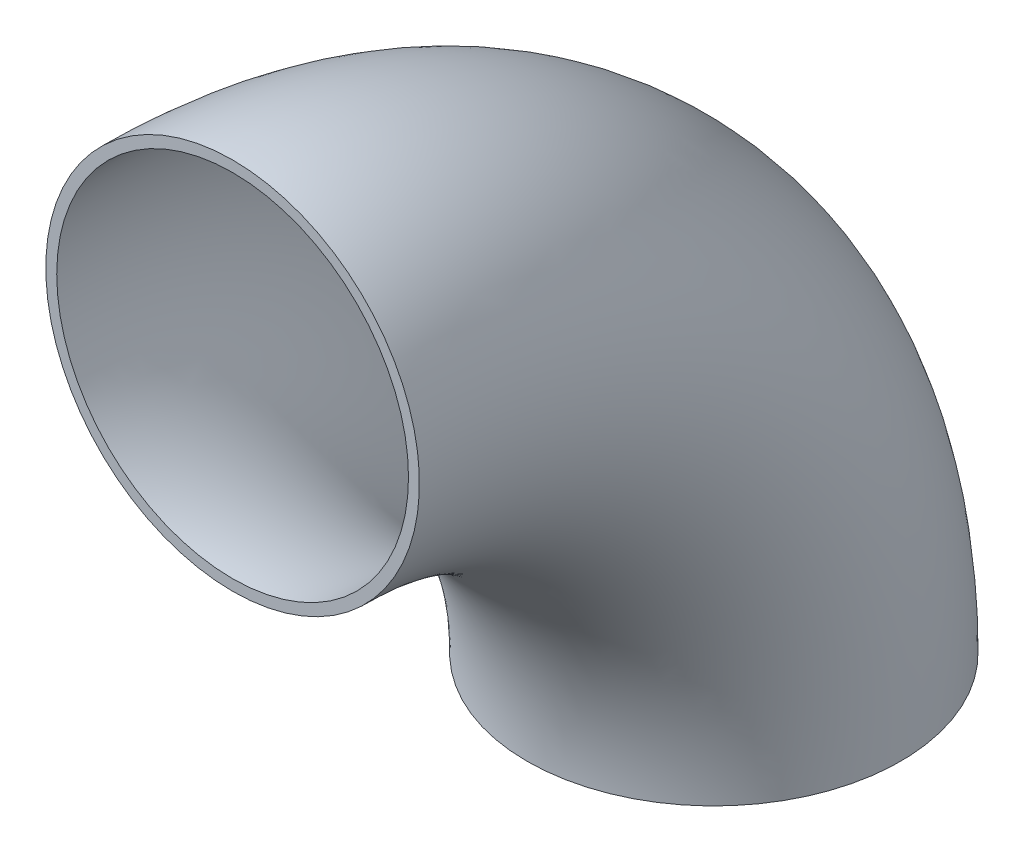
from build123d import *

# Parameters (mm, degrees)
SKIZZE2_R   = 44.45
SKIZZE2_R_2 = 41.85


with BuildPart() as part:
    # Austragung1: sweep along a path in RohrBogen
    with BuildLine(Plane(origin=(0, 0, 0), x_dir=(0, 0, -1), z_dir=(1, 0, 0))) as austragung1_path:
        ThreePointArc((114.5, 0), (80.963726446, 80.963726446), (0, 114.5))
    # Skizze2 → Austragung1 (sweep)
    with BuildSketch(Plane(origin=(0, 0, 0), x_dir=(1, 0, 0), z_dir=(0, 1, 0))):
        with Locations((0, 114.5)):
            Circle(SKIZZE2_R)
        with Locations((0, 114.5)):
            Circle(SKIZZE2_R_2, mode=Mode.SUBTRACT)
    sweep(path=austragung1_path.line)


solid = part.part
